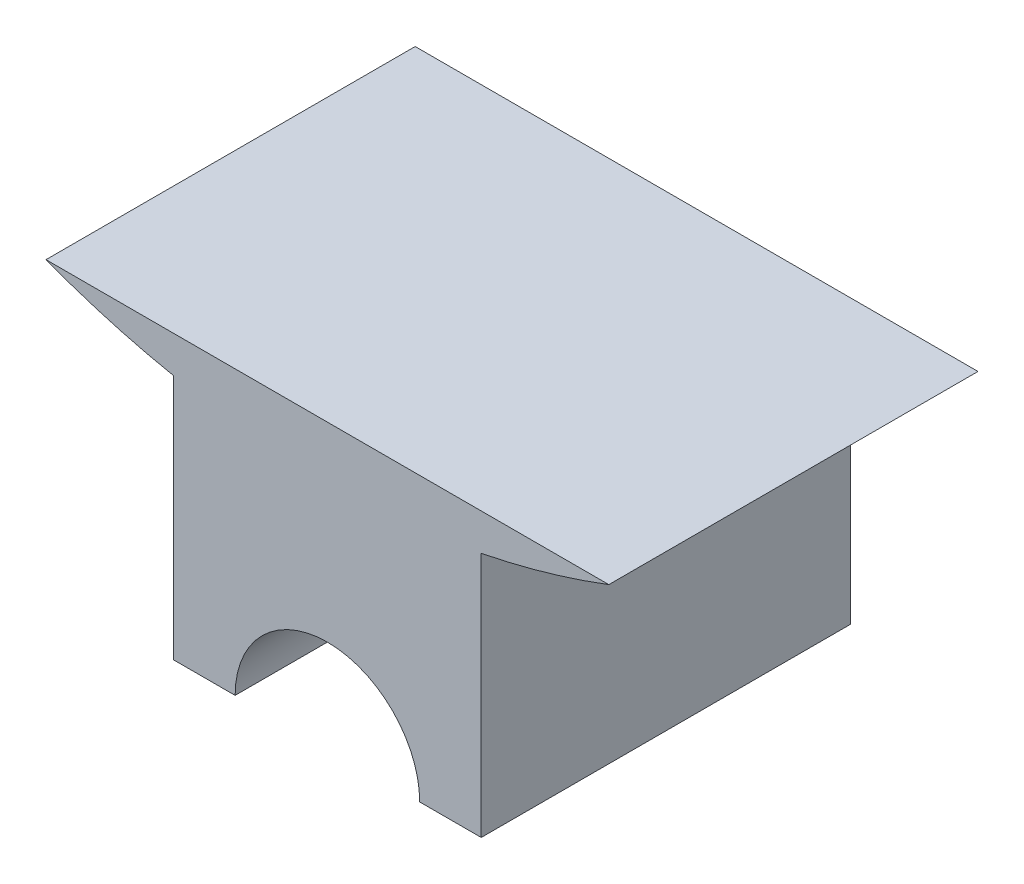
ISO-10303-21;
HEADER;
FILE_DESCRIPTION(('STEP AP214'),'2;1');
FILE_NAME('part.step','',(''),(''),'','','');
FILE_SCHEMA(('AUTOMOTIVE_DESIGN { 1 0 10303 214 1 1 1 1 }'));
ENDSEC;
DATA;
#1=APPLICATION_CONTEXT('core data for automotive mechanical design processes');
#2=APPLICATION_PROTOCOL_DEFINITION('international standard','automotive_design',2000,#1);
#3=PRODUCT_CONTEXT('',#1,'mechanical');
#4=PRODUCT('Part','Part','',(#3));
#5=PRODUCT_RELATED_PRODUCT_CATEGORY('part','',(#4));
#6=PRODUCT_DEFINITION_FORMATION('','',#4);
#7=PRODUCT_DEFINITION_CONTEXT('part definition',#1,'design');
#8=PRODUCT_DEFINITION('design','',#6,#7);
#9=PRODUCT_DEFINITION_SHAPE('','',#8);
#10=(LENGTH_UNIT() NAMED_UNIT(*) SI_UNIT(.MILLI.,.METRE.));
#11=(NAMED_UNIT(*) PLANE_ANGLE_UNIT() SI_UNIT($,.RADIAN.));
#12=(NAMED_UNIT(*) SI_UNIT($,.STERADIAN.) SOLID_ANGLE_UNIT());
#13=UNCERTAINTY_MEASURE_WITH_UNIT(LENGTH_MEASURE(1.E-05),#10,'distance_accuracy_value','');
#14=(GEOMETRIC_REPRESENTATION_CONTEXT(3) GLOBAL_UNCERTAINTY_ASSIGNED_CONTEXT((#13)) GLOBAL_UNIT_ASSIGNED_CONTEXT((#10,
#11,#12)) REPRESENTATION_CONTEXT('',''));
#15=CARTESIAN_POINT('',(0.,0.,0.));
#16=DIRECTION('',(0.,0.,1.));
#17=DIRECTION('',(1.,0.,0.));
#18=AXIS2_PLACEMENT_3D('',#15,#16,#17);
#19=CARTESIAN_POINT('',(15.25,-18.1149150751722,31.960019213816));
#20=DIRECTION('',(0.,1.,0.));
#21=DIRECTION('',(0.,0.,1.));
#22=AXIS2_PLACEMENT_3D('',#19,#20,#21);
#23=PLANE('',#22);
#24=DIRECTION('',(0.,0.,-1.));
#25=VECTOR('',#24,1.);
#26=CARTESIAN_POINT('',(15.25,-18.1149150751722,31.960019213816));
#27=LINE('',#26,#25);
#28=CARTESIAN_POINT('',(15.25,-18.1149150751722,35.460019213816));
#29=VERTEX_POINT('',#28);
#30=CARTESIAN_POINT('',(15.25,-18.1149150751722,32.460019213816));
#31=VERTEX_POINT('',#30);
#32=EDGE_CURVE('E129',#29,#31,#27,.T.);
#33=ORIENTED_EDGE('',*,*,#32,.T.);
#34=DIRECTION('',(1.,0.,0.));
#35=VECTOR('',#34,1.);
#36=CARTESIAN_POINT('',(15.25,-18.1149150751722,32.460019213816));
#37=LINE('',#36,#35);
#38=CARTESIAN_POINT('',(15.75,-18.1149150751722,32.460019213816));
#39=VERTEX_POINT('',#38);
#40=EDGE_CURVE('E146',#39,#31,#37,.F.);
#41=ORIENTED_EDGE('',*,*,#40,.F.);
#42=DIRECTION('',(0.,0.,1.));
#43=VECTOR('',#42,1.);
#44=CARTESIAN_POINT('',(15.75,-18.1149150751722,31.960019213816));
#45=LINE('',#44,#43);
#46=CARTESIAN_POINT('',(15.75,-18.1149150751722,35.460019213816));
#47=VERTEX_POINT('',#46);
#48=EDGE_CURVE('E122',#39,#47,#45,.T.);
#49=ORIENTED_EDGE('',*,*,#48,.T.);
#50=DIRECTION('',(1.,0.,0.));
#51=VECTOR('',#50,1.);
#52=CARTESIAN_POINT('',(15.25,-18.1149150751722,35.460019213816));
#53=LINE('',#52,#51);
#54=EDGE_CURVE('E139',#29,#47,#53,.T.);
#55=ORIENTED_EDGE('',*,*,#54,.F.);
#56=EDGE_LOOP('',(#33,#41,#49,#55));
#57=FACE_BOUND('',#56,.T.);
#58=ADVANCED_FACE('F17',(#57),#23,.F.);
#59=CARTESIAN_POINT('',(17.75,-18.1149150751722,31.960019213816));
#60=DIRECTION('',(0.,1.,0.));
#61=DIRECTION('',(0.,0.,1.));
#62=AXIS2_PLACEMENT_3D('',#59,#60,#61);
#63=PLANE('',#62);
#64=DIRECTION('',(0.,0.,1.));
#65=VECTOR('',#64,1.);
#66=CARTESIAN_POINT('',(17.25,-18.1149150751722,31.960019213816));
#67=LINE('',#66,#65);
#68=CARTESIAN_POINT('',(17.25,-18.1149150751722,35.460019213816));
#69=VERTEX_POINT('',#68);
#70=CARTESIAN_POINT('',(17.25,-18.1149150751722,32.460019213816));
#71=VERTEX_POINT('',#70);
#72=EDGE_CURVE('E127',#69,#71,#67,.F.);
#73=ORIENTED_EDGE('',*,*,#72,.T.);
#74=DIRECTION('',(1.,0.,0.));
#75=VECTOR('',#74,1.);
#76=CARTESIAN_POINT('',(17.75,-18.1149150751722,32.460019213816));
#77=LINE('',#76,#75);
#78=CARTESIAN_POINT('',(17.75,-18.1149150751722,32.460019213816));
#79=VERTEX_POINT('',#78);
#80=EDGE_CURVE('E70',#79,#71,#77,.F.);
#81=ORIENTED_EDGE('',*,*,#80,.F.);
#82=DIRECTION('',(0.,0.,1.));
#83=VECTOR('',#82,1.);
#84=CARTESIAN_POINT('',(17.75,-18.1149150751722,31.960019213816));
#85=LINE('',#84,#83);
#86=CARTESIAN_POINT('',(17.75,-18.1149150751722,35.460019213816));
#87=VERTEX_POINT('',#86);
#88=EDGE_CURVE('E117',#79,#87,#85,.T.);
#89=ORIENTED_EDGE('',*,*,#88,.T.);
#90=DIRECTION('',(1.,0.,0.));
#91=VECTOR('',#90,1.);
#92=CARTESIAN_POINT('',(17.75,-18.1149150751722,35.460019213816));
#93=LINE('',#92,#91);
#94=EDGE_CURVE('E132',#69,#87,#93,.T.);
#95=ORIENTED_EDGE('',*,*,#94,.F.);
#96=EDGE_LOOP('',(#73,#81,#89,#95));
#97=FACE_BOUND('',#96,.T.);
#98=ADVANCED_FACE('F246',(#97),#63,.F.);
#99=CARTESIAN_POINT('',(15.25,-16.1149150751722,31.960019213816));
#100=DIRECTION('',(1.,0.,0.));
#101=DIRECTION('',(0.,0.,-1.));
#102=AXIS2_PLACEMENT_3D('',#99,#100,#101);
#103=PLANE('',#102);
#104=DIRECTION('',(0.,0.,1.));
#105=VECTOR('',#104,1.);
#106=CARTESIAN_POINT('',(15.25,-16.1149150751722,31.960019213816));
#107=LINE('',#106,#105);
#108=CARTESIAN_POINT('',(15.25,-16.1149150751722,32.460019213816));
#109=VERTEX_POINT('',#108);
#110=CARTESIAN_POINT('',(15.25,-16.1149150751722,35.460019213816));
#111=VERTEX_POINT('',#110);
#112=EDGE_CURVE('E135',#109,#111,#107,.T.);
#113=ORIENTED_EDGE('',*,*,#112,.F.);
#114=DIRECTION('',(0.,1.,0.));
#115=VECTOR('',#114,1.);
#116=CARTESIAN_POINT('',(15.25,3.18527838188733,32.460019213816));
#117=LINE('',#116,#115);
#118=EDGE_CURVE('E112',#31,#109,#117,.T.);
#119=ORIENTED_EDGE('',*,*,#118,.F.);
#120=ORIENTED_EDGE('',*,*,#32,.F.);
#121=DIRECTION('',(0.,1.,0.));
#122=VECTOR('',#121,1.);
#123=CARTESIAN_POINT('',(15.25,3.18527838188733,35.460019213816));
#124=LINE('',#123,#122);
#125=EDGE_CURVE('E158',#111,#29,#124,.F.);
#126=ORIENTED_EDGE('',*,*,#125,.F.);
#127=EDGE_LOOP('',(#113,#119,#120,#126));
#128=FACE_BOUND('',#127,.T.);
#129=ADVANCED_FACE('F183',(#128),#103,.F.);
#130=CARTESIAN_POINT('',(16.5,-18.1149150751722,31.960019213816));
#131=DIRECTION('',(0.,0.,1.));
#132=DIRECTION('',(1.,0.,0.));
#133=AXIS2_PLACEMENT_3D('',#130,#131,#132);
#134=CYLINDRICAL_SURFACE('',#133,0.750000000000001);
#135=ORIENTED_EDGE('',*,*,#48,.F.);
#136=CARTESIAN_POINT('',(16.5,-18.1149150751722,32.460019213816));
#137=DIRECTION('',(0.,0.,1.));
#138=DIRECTION('',(1.,0.,0.));
#139=AXIS2_PLACEMENT_3D('',#136,#137,#138);
#140=CIRCLE('',#139,0.750000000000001);
#141=EDGE_CURVE('E20',#71,#39,#140,.T.);
#142=ORIENTED_EDGE('',*,*,#141,.F.);
#143=ORIENTED_EDGE('',*,*,#72,.F.);
#144=CARTESIAN_POINT('',(16.5,-18.1149150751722,35.460019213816));
#145=DIRECTION('',(0.,0.,1.));
#146=DIRECTION('',(1.,0.,0.));
#147=AXIS2_PLACEMENT_3D('',#144,#145,#146);
#148=CIRCLE('',#147,0.750000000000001);
#149=EDGE_CURVE('E155',#47,#69,#148,.F.);
#150=ORIENTED_EDGE('',*,*,#149,.F.);
#151=EDGE_LOOP('',(#135,#142,#143,#150));
#152=FACE_BOUND('',#151,.T.);
#153=ADVANCED_FACE('F175',(#152),#134,.F.);
#154=CARTESIAN_POINT('',(17.75,-16.1149150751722,31.960019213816));
#155=DIRECTION('',(-1.,0.,0.));
#156=DIRECTION('',(0.,0.,1.));
#157=AXIS2_PLACEMENT_3D('',#154,#155,#156);
#158=PLANE('',#157);
#159=ORIENTED_EDGE('',*,*,#88,.F.);
#160=DIRECTION('',(0.,1.,0.));
#161=VECTOR('',#160,1.);
#162=CARTESIAN_POINT('',(17.75,3.18527838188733,32.460019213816));
#163=LINE('',#162,#161);
#164=CARTESIAN_POINT('',(17.75,-16.1149150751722,32.460019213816));
#165=VERTEX_POINT('',#164);
#166=EDGE_CURVE('E85',#165,#79,#163,.F.);
#167=ORIENTED_EDGE('',*,*,#166,.F.);
#168=DIRECTION('',(0.,0.,1.));
#169=VECTOR('',#168,1.);
#170=CARTESIAN_POINT('',(17.75,-16.1149150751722,31.960019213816));
#171=LINE('',#170,#169);
#172=CARTESIAN_POINT('',(17.75,-16.1149150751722,35.460019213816));
#173=VERTEX_POINT('',#172);
#174=EDGE_CURVE('E104',#173,#165,#171,.F.);
#175=ORIENTED_EDGE('',*,*,#174,.F.);
#176=DIRECTION('',(0.,1.,0.));
#177=VECTOR('',#176,1.);
#178=CARTESIAN_POINT('',(17.75,3.18527838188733,35.460019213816));
#179=LINE('',#178,#177);
#180=EDGE_CURVE('E154',#87,#173,#179,.T.);
#181=ORIENTED_EDGE('',*,*,#180,.F.);
#182=EDGE_LOOP('',(#159,#167,#175,#181));
#183=FACE_BOUND('',#182,.T.);
#184=ADVANCED_FACE('F173',(#183),#158,.F.);
#185=CARTESIAN_POINT('',(10.8228756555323,3.18527838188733,32.460019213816));
#186=DIRECTION('',(0.,0.,-1.));
#187=DIRECTION('',(-1.,0.,0.));
#188=AXIS2_PLACEMENT_3D('',#185,#186,#187);
#189=PLANE('',#188);
#190=ORIENTED_EDGE('',*,*,#40,.T.);
#191=ORIENTED_EDGE('',*,*,#118,.T.);
#192=CARTESIAN_POINT('',(16.5,-9.81672161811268,32.460019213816));
#193=DIRECTION('',(0.,0.,1.));
#194=DIRECTION('',(1.,0.,0.));
#195=AXIS2_PLACEMENT_3D('',#192,#193,#194);
#196=CIRCLE('',#195,6.4210389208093);
#197=CARTESIAN_POINT('',(14.2131373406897,-15.8167216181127,32.460019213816));
#198=VERTEX_POINT('',#197);
#199=EDGE_CURVE('E95',#198,#109,#196,.T.);
#200=ORIENTED_EDGE('',*,*,#199,.F.);
#201=DIRECTION('',(1.,0.,0.));
#202=VECTOR('',#201,1.);
#203=CARTESIAN_POINT('',(0.,-15.8167216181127,32.460019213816));
#204=LINE('',#203,#202);
#205=CARTESIAN_POINT('',(18.7868626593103,-15.8167216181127,32.460019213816));
#206=VERTEX_POINT('',#205);
#207=EDGE_CURVE('E89',#206,#198,#204,.F.);
#208=ORIENTED_EDGE('',*,*,#207,.F.);
#209=CARTESIAN_POINT('',(16.5,-9.81672161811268,32.460019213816));
#210=DIRECTION('',(0.,0.,1.));
#211=DIRECTION('',(1.,0.,0.));
#212=AXIS2_PLACEMENT_3D('',#209,#210,#211);
#213=CIRCLE('',#212,6.4210389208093);
#214=EDGE_CURVE('E92',#165,#206,#213,.T.);
#215=ORIENTED_EDGE('',*,*,#214,.F.);
#216=ORIENTED_EDGE('',*,*,#166,.T.);
#217=ORIENTED_EDGE('',*,*,#80,.T.);
#218=ORIENTED_EDGE('',*,*,#141,.T.);
#219=EDGE_LOOP('',(#190,#191,#200,#208,#215,#216,#217,#218));
#220=FACE_BOUND('',#219,.T.);
#221=ADVANCED_FACE('F91',(#220),#189,.T.);
#222=CARTESIAN_POINT('',(16.5,-9.81672161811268,31.960019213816));
#223=DIRECTION('',(0.,0.,1.));
#224=DIRECTION('',(1.,0.,0.));
#225=AXIS2_PLACEMENT_3D('',#222,#223,#224);
#226=CYLINDRICAL_SURFACE('',#225,6.4210389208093);
#227=ORIENTED_EDGE('',*,*,#112,.T.);
#228=CARTESIAN_POINT('',(16.5,-9.81672161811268,35.460019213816));
#229=DIRECTION('',(0.,0.,1.));
#230=DIRECTION('',(1.,0.,0.));
#231=AXIS2_PLACEMENT_3D('',#228,#229,#230);
#232=CIRCLE('',#231,6.4210389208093);
#233=CARTESIAN_POINT('',(14.2131373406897,-15.8167216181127,35.460019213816));
#234=VERTEX_POINT('',#233);
#235=EDGE_CURVE('E137',#234,#111,#232,.T.);
#236=ORIENTED_EDGE('',*,*,#235,.F.);
#237=DIRECTION('',(0.,0.,1.));
#238=VECTOR('',#237,1.);
#239=CARTESIAN_POINT('',(14.2131373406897,-15.8167216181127,0.));
#240=LINE('',#239,#238);
#241=EDGE_CURVE('E99',#198,#234,#240,.T.);
#242=ORIENTED_EDGE('',*,*,#241,.F.);
#243=ORIENTED_EDGE('',*,*,#199,.T.);
#244=EDGE_LOOP('',(#227,#236,#242,#243));
#245=FACE_BOUND('',#244,.T.);
#246=ADVANCED_FACE('F160',(#245),#226,.T.);
#247=CARTESIAN_POINT('',(11.5,3.18527838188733,35.460019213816));
#248=DIRECTION('',(0.,0.,1.));
#249=DIRECTION('',(1.,0.,0.));
#250=AXIS2_PLACEMENT_3D('',#247,#248,#249);
#251=PLANE('',#250);
#252=ORIENTED_EDGE('',*,*,#94,.T.);
#253=ORIENTED_EDGE('',*,*,#180,.T.);
#254=CARTESIAN_POINT('',(16.5,-9.81672161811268,35.460019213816));
#255=DIRECTION('',(0.,0.,1.));
#256=DIRECTION('',(1.,0.,0.));
#257=AXIS2_PLACEMENT_3D('',#254,#255,#256);
#258=CIRCLE('',#257,6.4210389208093);
#259=CARTESIAN_POINT('',(18.7868626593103,-15.8167216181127,35.460019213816));
#260=VERTEX_POINT('',#259);
#261=EDGE_CURVE('E35',#260,#173,#258,.F.);
#262=ORIENTED_EDGE('',*,*,#261,.F.);
#263=DIRECTION('',(1.,0.,0.));
#264=VECTOR('',#263,1.);
#265=CARTESIAN_POINT('',(0.,-15.8167216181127,35.460019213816));
#266=LINE('',#265,#264);
#267=EDGE_CURVE('E26',#234,#260,#266,.T.);
#268=ORIENTED_EDGE('',*,*,#267,.F.);
#269=ORIENTED_EDGE('',*,*,#235,.T.);
#270=ORIENTED_EDGE('',*,*,#125,.T.);
#271=ORIENTED_EDGE('',*,*,#54,.T.);
#272=ORIENTED_EDGE('',*,*,#149,.T.);
#273=EDGE_LOOP('',(#252,#253,#262,#268,#269,#270,#271,#272));
#274=FACE_BOUND('',#273,.T.);
#275=ADVANCED_FACE('F164',(#274),#251,.T.);
#276=CARTESIAN_POINT('',(16.5,-9.81672161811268,31.960019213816));
#277=DIRECTION('',(0.,0.,1.));
#278=DIRECTION('',(1.,0.,0.));
#279=AXIS2_PLACEMENT_3D('',#276,#277,#278);
#280=CYLINDRICAL_SURFACE('',#279,6.4210389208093);
#281=ORIENTED_EDGE('',*,*,#174,.T.);
#282=ORIENTED_EDGE('',*,*,#214,.T.);
#283=DIRECTION('',(0.,0.,1.));
#284=VECTOR('',#283,1.);
#285=CARTESIAN_POINT('',(18.7868626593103,-15.8167216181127,0.));
#286=LINE('',#285,#284);
#287=EDGE_CURVE('E11',#260,#206,#286,.F.);
#288=ORIENTED_EDGE('',*,*,#287,.F.);
#289=ORIENTED_EDGE('',*,*,#261,.T.);
#290=EDGE_LOOP('',(#281,#282,#288,#289));
#291=FACE_BOUND('',#290,.T.);
#292=ADVANCED_FACE('F102',(#291),#280,.T.);
#293=CARTESIAN_POINT('',(0.,-15.8167216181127,0.));
#294=DIRECTION('',(0.,1.,0.));
#295=DIRECTION('',(0.,0.,1.));
#296=AXIS2_PLACEMENT_3D('',#293,#294,#295);
#297=PLANE('',#296);
#298=ORIENTED_EDGE('',*,*,#267,.T.);
#299=ORIENTED_EDGE('',*,*,#287,.T.);
#300=ORIENTED_EDGE('',*,*,#207,.T.);
#301=ORIENTED_EDGE('',*,*,#241,.T.);
#302=EDGE_LOOP('',(#298,#299,#300,#301));
#303=FACE_BOUND('',#302,.T.);
#304=ADVANCED_FACE('F106',(#303),#297,.T.);
#305=CLOSED_SHELL('',(#58,#98,#129,#153,#184,#221,#246,#275,#292,#304));
#306=MANIFOLD_SOLID_BREP('B1',#305);
#307=ADVANCED_BREP_SHAPE_REPRESENTATION('',(#18,#306),#14);
#308=SHAPE_DEFINITION_REPRESENTATION(#9,#307);
ENDSEC;
END-ISO-10303-21;
